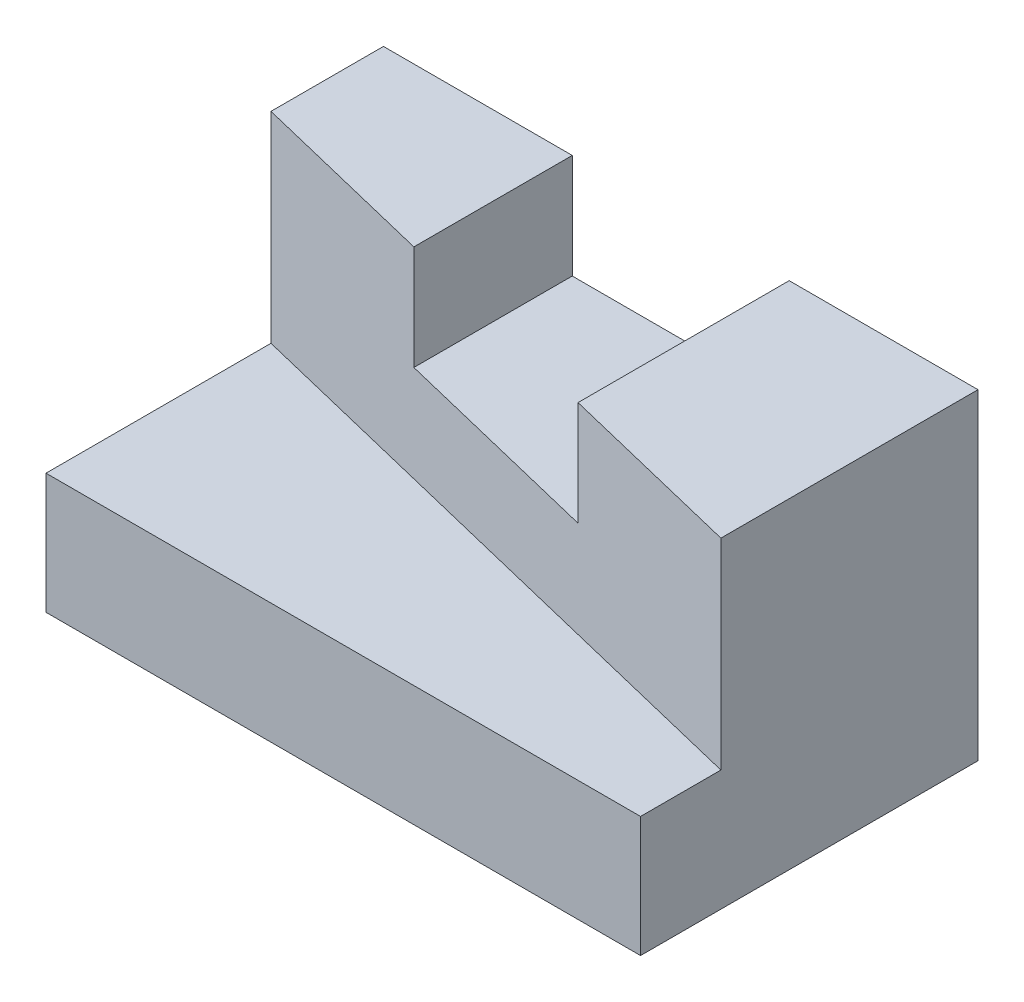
from build123d import *

# Parameters (mm, degrees)
EXTRUDE_1_DEPTH     = 42
CUT_EXTRUDE_1_DEPTH = 25


with BuildPart() as part:
    # Sketch 2 → Extrude 1 (new body)
    with BuildSketch(Plane.XY):
        Polygon((13.5, 20), (13.5, 7), (-13.5, 7), (-13.5, 20), (-37, 20), (-37, -20), (37, -20), (37, 20), align=None)
    extrude(amount=EXTRUDE_1_DEPTH)

    # Sketch 3 → Cut-Extrude 1 (cut)
    with BuildSketch(Plane(origin=(0, 20, 0), x_dir=(1, 0, 0), z_dir=(0, 1, 0))):
        Polygon((37, -32), (37, -42), (-37, -42), (-37, -14), align=None)
    extrude(amount=-CUT_EXTRUDE_1_DEPTH, mode=Mode.SUBTRACT)


solid = part.part
